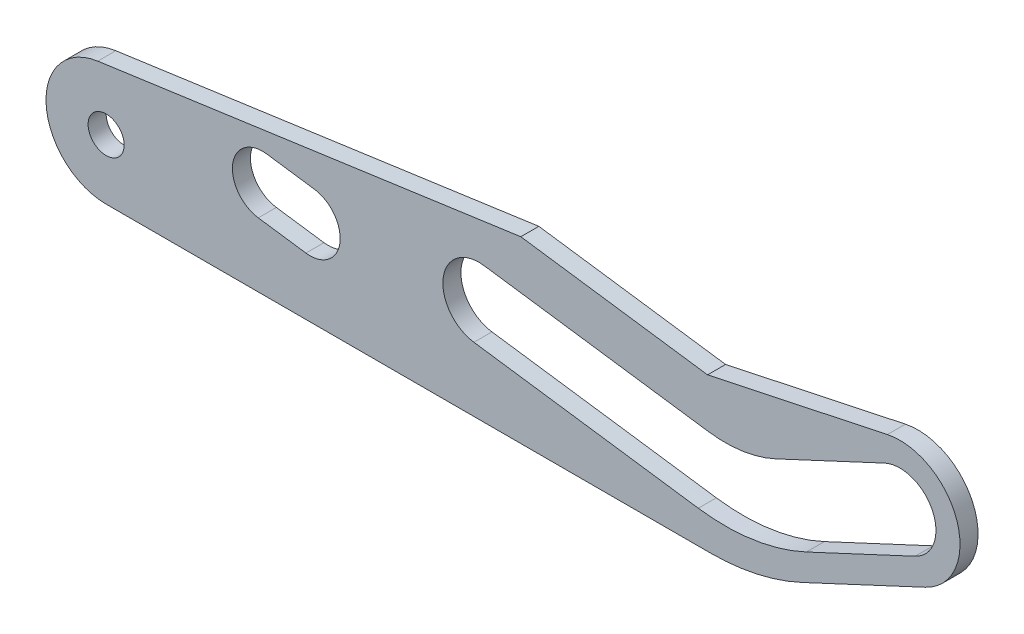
ISO-10303-21;
HEADER;
FILE_DESCRIPTION(('STEP AP214'),'2;1');
FILE_NAME('part.step','',(''),(''),'','','');
FILE_SCHEMA(('AUTOMOTIVE_DESIGN { 1 0 10303 214 1 1 1 1 }'));
ENDSEC;
DATA;
#1=APPLICATION_CONTEXT('core data for automotive mechanical design processes');
#2=APPLICATION_PROTOCOL_DEFINITION('international standard','automotive_design',2000,#1);
#3=PRODUCT_CONTEXT('',#1,'mechanical');
#4=PRODUCT('Part','Part','',(#3));
#5=PRODUCT_RELATED_PRODUCT_CATEGORY('part','',(#4));
#6=PRODUCT_DEFINITION_FORMATION('','',#4);
#7=PRODUCT_DEFINITION_CONTEXT('part definition',#1,'design');
#8=PRODUCT_DEFINITION('design','',#6,#7);
#9=PRODUCT_DEFINITION_SHAPE('','',#8);
#10=(LENGTH_UNIT() NAMED_UNIT(*) SI_UNIT(.MILLI.,.METRE.));
#11=(NAMED_UNIT(*) PLANE_ANGLE_UNIT() SI_UNIT($,.RADIAN.));
#12=(NAMED_UNIT(*) SI_UNIT($,.STERADIAN.) SOLID_ANGLE_UNIT());
#13=UNCERTAINTY_MEASURE_WITH_UNIT(LENGTH_MEASURE(1.E-05),#10,'distance_accuracy_value','');
#14=(GEOMETRIC_REPRESENTATION_CONTEXT(3) GLOBAL_UNCERTAINTY_ASSIGNED_CONTEXT((#13)) GLOBAL_UNIT_ASSIGNED_CONTEXT((#10,
#11,#12)) REPRESENTATION_CONTEXT('',''));
#15=CARTESIAN_POINT('',(0.,0.,0.));
#16=DIRECTION('',(0.,0.,1.));
#17=DIRECTION('',(1.,0.,0.));
#18=AXIS2_PLACEMENT_3D('',#15,#16,#17);
#19=CARTESIAN_POINT('',(0.,0.,0.75));
#20=DIRECTION('',(0.,0.,1.));
#21=DIRECTION('',(1.,0.,0.));
#22=AXIS2_PLACEMENT_3D('',#19,#20,#21);
#23=PLANE('',#22);
#24=CARTESIAN_POINT('',(0.,0.,0.75));
#25=DIRECTION('',(0.,0.,1.));
#26=DIRECTION('',(1.,0.,0.));
#27=AXIS2_PLACEMENT_3D('',#24,#25,#26);
#28=CIRCLE('',#27,1.5);
#29=CARTESIAN_POINT('',(1.5,0.,0.75));
#30=VERTEX_POINT('',#29);
#31=EDGE_CURVE('E180',#30,#30,#28,.T.);
#32=ORIENTED_EDGE('',*,*,#31,.F.);
#33=EDGE_LOOP('',(#32));
#34=FACE_BOUND('',#33,.T.);
#35=CARTESIAN_POINT('',(0.,0.,0.75));
#36=DIRECTION('',(0.,0.,1.));
#37=DIRECTION('',(1.,0.,0.));
#38=AXIS2_PLACEMENT_3D('',#35,#36,#37);
#39=CIRCLE('',#38,5.);
#40=CARTESIAN_POINT('',(-0.695865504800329,4.95134034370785,0.75));
#41=VERTEX_POINT('',#40);
#42=CARTESIAN_POINT('',(0.,-5.,0.75));
#43=VERTEX_POINT('',#42);
#44=EDGE_CURVE('E294',#41,#43,#39,.T.);
#45=ORIENTED_EDGE('',*,*,#44,.T.);
#46=DIRECTION('',(1.,0.,0.));
#47=VECTOR('',#46,1.);
#48=CARTESIAN_POINT('',(0.,-5.,0.75));
#49=LINE('',#48,#47);
#50=CARTESIAN_POINT('',(50.2509278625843,-5.,0.75));
#51=VERTEX_POINT('',#50);
#52=EDGE_CURVE('E297',#43,#51,#49,.T.);
#53=ORIENTED_EDGE('',*,*,#52,.T.);
#54=CARTESIAN_POINT('',(50.2509278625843,13.,0.75));
#55=DIRECTION('',(0.,0.,1.));
#56=DIRECTION('',(1.,0.,0.));
#57=AXIS2_PLACEMENT_3D('',#54,#55,#56);
#58=CIRCLE('',#57,18.);
#59=CARTESIAN_POINT('',(57.8580565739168,-3.31354016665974,0.75));
#60=VERTEX_POINT('',#59);
#61=EDGE_CURVE('E299',#51,#60,#58,.T.);
#62=ORIENTED_EDGE('',*,*,#61,.T.);
#63=DIRECTION('',(0.906307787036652,0.422618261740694,0.));
#64=VECTOR('',#63,1.);
#65=CARTESIAN_POINT('',(68.1130913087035,1.46846106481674,0.75));
#66=LINE('',#65,#64);
#67=CARTESIAN_POINT('',(68.1130913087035,1.46846106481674,0.75));
#68=VERTEX_POINT('',#67);
#69=EDGE_CURVE('E301',#60,#68,#66,.T.);
#70=ORIENTED_EDGE('',*,*,#69,.T.);
#71=CARTESIAN_POINT('',(66.,6.,0.75));
#72=DIRECTION('',(0.,0.,1.));
#73=DIRECTION('',(1.,0.,0.));
#74=AXIS2_PLACEMENT_3D('',#71,#72,#73);
#75=CIRCLE('',#74,5.);
#76=CARTESIAN_POINT('',(64.9604415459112,10.890738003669,0.75));
#77=VERTEX_POINT('',#76);
#78=EDGE_CURVE('E303',#68,#77,#75,.T.);
#79=ORIENTED_EDGE('',*,*,#78,.T.);
#80=DIRECTION('',(-0.978147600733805,-0.207911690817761,0.));
#81=VECTOR('',#80,1.);
#82=CARTESIAN_POINT('',(50.0091398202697,7.71274071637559,0.75));
#83=LINE('',#82,#81);
#84=CARTESIAN_POINT('',(50.0091398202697,7.71274071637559,0.75));
#85=VERTEX_POINT('',#84);
#86=EDGE_CURVE('E305',#77,#85,#83,.T.);
#87=ORIENTED_EDGE('',*,*,#86,.T.);
#88=DIRECTION('',(-0.99026806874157,0.139173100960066,0.));
#89=VECTOR('',#88,1.);
#90=CARTESIAN_POINT('',(34.480829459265,9.89510241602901,0.75));
#91=LINE('',#90,#89);
#92=CARTESIAN_POINT('',(34.480829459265,9.89510241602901,0.75));
#93=VERTEX_POINT('',#92);
#94=EDGE_CURVE('E307',#85,#93,#91,.T.);
#95=ORIENTED_EDGE('',*,*,#94,.T.);
#96=DIRECTION('',(-0.99026806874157,-0.139173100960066,0.));
#97=VECTOR('',#96,1.);
#98=CARTESIAN_POINT('',(-0.695865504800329,4.95134034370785,0.75));
#99=LINE('',#98,#97);
#100=EDGE_CURVE('E309',#93,#41,#99,.T.);
#101=ORIENTED_EDGE('',*,*,#100,.T.);
#102=EDGE_LOOP('',(#45,#53,#62,#70,#79,#87,#95,#101));
#103=FACE_BOUND('',#102,.T.);
#104=DIRECTION('',(0.906307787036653,0.422618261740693,0.));
#105=VECTOR('',#104,1.);
#106=CARTESIAN_POINT('',(67.2678547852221,3.28107663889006,0.75));
#107=LINE('',#106,#105);
#108=CARTESIAN_POINT('',(58.2284860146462,-0.934050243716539,0.75));
#109=VERTEX_POINT('',#108);
#110=CARTESIAN_POINT('',(67.2678547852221,3.28107663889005,0.75));
#111=VERTEX_POINT('',#110);
#112=EDGE_CURVE('E265',#109,#111,#107,.T.);
#113=ORIENTED_EDGE('',*,*,#112,.F.);
#114=CARTESIAN_POINT('',(51.4665938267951,13.5668743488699,0.75));
#115=DIRECTION('',(0.,0.,1.));
#116=DIRECTION('',(1.,0.,0.));
#117=AXIS2_PLACEMENT_3D('',#114,#115,#116);
#118=CIRCLE('',#117,16.);
#119=CARTESIAN_POINT('',(49.239824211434,-2.27741475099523,0.75));
#120=VERTEX_POINT('',#119);
#121=EDGE_CURVE('E263',#120,#109,#118,.T.);
#122=ORIENTED_EDGE('',*,*,#121,.F.);
#123=DIRECTION('',(0.99026806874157,-0.139173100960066,0.));
#124=VECTOR('',#123,1.);
#125=CARTESIAN_POINT('',(30.5824806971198,0.344703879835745,0.75));
#126=LINE('',#125,#124);
#127=CARTESIAN_POINT('',(30.5824806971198,0.344703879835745,0.75));
#128=VERTEX_POINT('',#127);
#129=EDGE_CURVE('E277',#128,#120,#126,.T.);
#130=ORIENTED_EDGE('',*,*,#129,.F.);
#131=CARTESIAN_POINT('',(31.,3.31550808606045,0.75));
#132=DIRECTION('',(0.,0.,1.));
#133=DIRECTION('',(1.,0.,0.));
#134=AXIS2_PLACEMENT_3D('',#131,#132,#133);
#135=CIRCLE('',#134,3.);
#136=CARTESIAN_POINT('',(31.4175193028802,6.28631229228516,0.75));
#137=VERTEX_POINT('',#136);
#138=EDGE_CURVE('E275',#137,#128,#135,.T.);
#139=ORIENTED_EDGE('',*,*,#138,.F.);
#140=DIRECTION('',(-0.99026806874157,0.139173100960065,0.));
#141=VECTOR('',#140,1.);
#142=CARTESIAN_POINT('',(31.4175193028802,6.28631229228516,0.75));
#143=LINE('',#142,#141);
#144=CARTESIAN_POINT('',(50.0748628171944,3.6641936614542,0.75));
#145=VERTEX_POINT('',#144);
#146=EDGE_CURVE('E273',#145,#137,#143,.T.);
#147=ORIENTED_EDGE('',*,*,#146,.F.);
#148=CARTESIAN_POINT('',(51.4665938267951,13.5668743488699,0.75));
#149=DIRECTION('',(0.,0.,-1.));
#150=DIRECTION('',(1.,0.,0.));
#151=AXIS2_PLACEMENT_3D('',#148,#149,#150);
#152=CIRCLE('',#151,9.99999999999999);
#153=CARTESIAN_POINT('',(55.692776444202,4.50379647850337,0.75));
#154=VERTEX_POINT('',#153);
#155=EDGE_CURVE('E271',#154,#145,#152,.T.);
#156=ORIENTED_EDGE('',*,*,#155,.F.);
#157=DIRECTION('',(-0.906307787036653,-0.422618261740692,0.));
#158=VECTOR('',#157,1.);
#159=CARTESIAN_POINT('',(64.7321452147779,8.71892336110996,0.75));
#160=LINE('',#159,#158);
#161=CARTESIAN_POINT('',(64.7321452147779,8.71892336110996,0.75));
#162=VERTEX_POINT('',#161);
#163=EDGE_CURVE('E269',#162,#154,#160,.T.);
#164=ORIENTED_EDGE('',*,*,#163,.F.);
#165=CARTESIAN_POINT('',(66.,6.,0.75));
#166=DIRECTION('',(0.,0.,1.));
#167=DIRECTION('',(1.,0.,0.));
#168=AXIS2_PLACEMENT_3D('',#165,#166,#167);
#169=CIRCLE('',#168,2.99999999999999);
#170=EDGE_CURVE('E267',#111,#162,#169,.T.);
#171=ORIENTED_EDGE('',*,*,#170,.F.);
#172=EDGE_LOOP('',(#113,#122,#130,#139,#147,#156,#164,#171));
#173=FACE_BOUND('',#172,.T.);
#174=DIRECTION('',(-0.99026806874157,0.139173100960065,0.));
#175=VECTOR('',#174,1.);
#176=CARTESIAN_POINT('',(17.3090050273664,4.73473816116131,0.75));
#177=LINE('',#176,#175);
#178=CARTESIAN_POINT('',(17.3090050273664,4.73473816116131,0.75));
#179=VERTEX_POINT('',#178);
#180=CARTESIAN_POINT('',(13.3479327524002,5.29143056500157,0.75));
#181=VERTEX_POINT('',#180);
#182=EDGE_CURVE('E251',#179,#181,#177,.T.);
#183=ORIENTED_EDGE('',*,*,#182,.F.);
#184=CARTESIAN_POINT('',(16.9610722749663,2.25906798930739,0.75));
#185=DIRECTION('',(0.,0.,1.));
#186=DIRECTION('',(1.,0.,0.));
#187=AXIS2_PLACEMENT_3D('',#184,#185,#186);
#188=CIRCLE('',#187,2.5);
#189=CARTESIAN_POINT('',(16.6131395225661,-0.21660218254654,0.75));
#190=VERTEX_POINT('',#189);
#191=EDGE_CURVE('E177',#190,#179,#188,.T.);
#192=ORIENTED_EDGE('',*,*,#191,.F.);
#193=DIRECTION('',(0.99026806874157,-0.139173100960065,0.));
#194=VECTOR('',#193,1.);
#195=CARTESIAN_POINT('',(16.6131395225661,-0.21660218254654,0.75));
#196=LINE('',#195,#194);
#197=CARTESIAN_POINT('',(12.6520672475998,0.340090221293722,0.75));
#198=VERTEX_POINT('',#197);
#199=EDGE_CURVE('E255',#198,#190,#196,.T.);
#200=ORIENTED_EDGE('',*,*,#199,.F.);
#201=CARTESIAN_POINT('',(13.,2.81576039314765,0.75));
#202=DIRECTION('',(0.,0.,1.));
#203=DIRECTION('',(1.,0.,0.));
#204=AXIS2_PLACEMENT_3D('',#201,#202,#203);
#205=CIRCLE('',#204,2.5);
#206=EDGE_CURVE('E253',#181,#198,#205,.T.);
#207=ORIENTED_EDGE('',*,*,#206,.F.);
#208=EDGE_LOOP('',(#183,#192,#200,#207));
#209=FACE_BOUND('',#208,.T.);
#210=ADVANCED_FACE('F33',(#34,#103,#173,#209),#23,.T.);
#211=CARTESIAN_POINT('',(0.,0.,0.75));
#212=DIRECTION('',(0.,0.,-1.));
#213=DIRECTION('',(-1.,0.,0.));
#214=AXIS2_PLACEMENT_3D('',#211,#212,#213);
#215=CYLINDRICAL_SURFACE('',#214,5.);
#216=DIRECTION('',(0.,0.,-1.));
#217=VECTOR('',#216,1.);
#218=CARTESIAN_POINT('',(-0.695865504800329,4.95134034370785,0.75));
#219=LINE('',#218,#217);
#220=CARTESIAN_POINT('',(-0.695865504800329,4.95134034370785,-0.75));
#221=VERTEX_POINT('',#220);
#222=EDGE_CURVE('E311',#41,#221,#219,.T.);
#223=ORIENTED_EDGE('',*,*,#222,.T.);
#224=CARTESIAN_POINT('',(0.,0.,-0.75));
#225=DIRECTION('',(0.,0.,1.));
#226=DIRECTION('',(1.,0.,0.));
#227=AXIS2_PLACEMENT_3D('',#224,#225,#226);
#228=CIRCLE('',#227,5.);
#229=CARTESIAN_POINT('',(0.,-5.,-0.75));
#230=VERTEX_POINT('',#229);
#231=EDGE_CURVE('E226',#221,#230,#228,.T.);
#232=ORIENTED_EDGE('',*,*,#231,.T.);
#233=DIRECTION('',(0.,0.,-1.));
#234=VECTOR('',#233,1.);
#235=CARTESIAN_POINT('',(0.,-5.,0.75));
#236=LINE('',#235,#234);
#237=EDGE_CURVE('E11',#43,#230,#236,.T.);
#238=ORIENTED_EDGE('',*,*,#237,.F.);
#239=ORIENTED_EDGE('',*,*,#44,.F.);
#240=EDGE_LOOP('',(#223,#232,#238,#239));
#241=FACE_BOUND('',#240,.T.);
#242=ADVANCED_FACE('F35',(#241),#215,.T.);
#243=CARTESIAN_POINT('',(0.,-5.,0.75));
#244=DIRECTION('',(0.,1.,0.));
#245=DIRECTION('',(-1.,0.,0.));
#246=AXIS2_PLACEMENT_3D('',#243,#244,#245);
#247=PLANE('',#246);
#248=ORIENTED_EDGE('',*,*,#237,.T.);
#249=DIRECTION('',(1.,0.,0.));
#250=VECTOR('',#249,1.);
#251=CARTESIAN_POINT('',(0.,-5.,-0.75));
#252=LINE('',#251,#250);
#253=CARTESIAN_POINT('',(50.2509278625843,-5.,-0.75));
#254=VERTEX_POINT('',#253);
#255=EDGE_CURVE('E229',#230,#254,#252,.T.);
#256=ORIENTED_EDGE('',*,*,#255,.T.);
#257=DIRECTION('',(0.,0.,-1.));
#258=VECTOR('',#257,1.);
#259=CARTESIAN_POINT('',(50.2509278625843,-5.,0.75));
#260=LINE('',#259,#258);
#261=EDGE_CURVE('E41',#51,#254,#260,.T.);
#262=ORIENTED_EDGE('',*,*,#261,.F.);
#263=ORIENTED_EDGE('',*,*,#52,.F.);
#264=EDGE_LOOP('',(#248,#256,#262,#263));
#265=FACE_BOUND('',#264,.T.);
#266=ADVANCED_FACE('F334',(#265),#247,.F.);
#267=CARTESIAN_POINT('',(50.2509278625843,13.,0.75));
#268=DIRECTION('',(0.,0.,-1.));
#269=DIRECTION('',(-1.,0.,0.));
#270=AXIS2_PLACEMENT_3D('',#267,#268,#269);
#271=CYLINDRICAL_SURFACE('',#270,18.);
#272=ORIENTED_EDGE('',*,*,#261,.T.);
#273=CARTESIAN_POINT('',(50.2509278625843,13.,-0.75));
#274=DIRECTION('',(0.,0.,1.));
#275=DIRECTION('',(1.,0.,0.));
#276=AXIS2_PLACEMENT_3D('',#273,#274,#275);
#277=CIRCLE('',#276,18.);
#278=CARTESIAN_POINT('',(57.8580565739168,-3.31354016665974,-0.75));
#279=VERTEX_POINT('',#278);
#280=EDGE_CURVE('E232',#254,#279,#277,.T.);
#281=ORIENTED_EDGE('',*,*,#280,.T.);
#282=DIRECTION('',(0.,0.,-1.));
#283=VECTOR('',#282,1.);
#284=CARTESIAN_POINT('',(57.8580565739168,-3.31354016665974,0.75));
#285=LINE('',#284,#283);
#286=EDGE_CURVE('E321',#60,#279,#285,.T.);
#287=ORIENTED_EDGE('',*,*,#286,.F.);
#288=ORIENTED_EDGE('',*,*,#61,.F.);
#289=EDGE_LOOP('',(#272,#281,#287,#288));
#290=FACE_BOUND('',#289,.T.);
#291=ADVANCED_FACE('F326',(#290),#271,.T.);
#292=CARTESIAN_POINT('',(68.1130913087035,1.46846106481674,0.75));
#293=DIRECTION('',(-0.422618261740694,0.906307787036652,0.));
#294=DIRECTION('',(-0.906307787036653,-0.422618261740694,0.));
#295=AXIS2_PLACEMENT_3D('',#292,#293,#294);
#296=PLANE('',#295);
#297=ORIENTED_EDGE('',*,*,#286,.T.);
#298=DIRECTION('',(0.906307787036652,0.422618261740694,0.));
#299=VECTOR('',#298,1.);
#300=CARTESIAN_POINT('',(68.1130913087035,1.46846106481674,-0.75));
#301=LINE('',#300,#299);
#302=CARTESIAN_POINT('',(68.1130913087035,1.46846106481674,-0.75));
#303=VERTEX_POINT('',#302);
#304=EDGE_CURVE('E235',#279,#303,#301,.T.);
#305=ORIENTED_EDGE('',*,*,#304,.T.);
#306=DIRECTION('',(0.,0.,-1.));
#307=VECTOR('',#306,1.);
#308=CARTESIAN_POINT('',(68.1130913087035,1.46846106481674,0.75));
#309=LINE('',#308,#307);
#310=EDGE_CURVE('E319',#68,#303,#309,.T.);
#311=ORIENTED_EDGE('',*,*,#310,.F.);
#312=ORIENTED_EDGE('',*,*,#69,.F.);
#313=EDGE_LOOP('',(#297,#305,#311,#312));
#314=FACE_BOUND('',#313,.T.);
#315=ADVANCED_FACE('F359',(#314),#296,.F.);
#316=CARTESIAN_POINT('',(66.,6.,0.75));
#317=DIRECTION('',(0.,0.,-1.));
#318=DIRECTION('',(-1.,0.,0.));
#319=AXIS2_PLACEMENT_3D('',#316,#317,#318);
#320=CYLINDRICAL_SURFACE('',#319,5.);
#321=ORIENTED_EDGE('',*,*,#310,.T.);
#322=CARTESIAN_POINT('',(66.,6.,-0.75));
#323=DIRECTION('',(0.,0.,1.));
#324=DIRECTION('',(1.,0.,0.));
#325=AXIS2_PLACEMENT_3D('',#322,#323,#324);
#326=CIRCLE('',#325,5.);
#327=CARTESIAN_POINT('',(64.9604415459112,10.890738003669,-0.75));
#328=VERTEX_POINT('',#327);
#329=EDGE_CURVE('E238',#303,#328,#326,.T.);
#330=ORIENTED_EDGE('',*,*,#329,.T.);
#331=DIRECTION('',(0.,0.,-1.));
#332=VECTOR('',#331,1.);
#333=CARTESIAN_POINT('',(64.9604415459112,10.890738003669,0.75));
#334=LINE('',#333,#332);
#335=EDGE_CURVE('E317',#77,#328,#334,.T.);
#336=ORIENTED_EDGE('',*,*,#335,.F.);
#337=ORIENTED_EDGE('',*,*,#78,.F.);
#338=EDGE_LOOP('',(#321,#330,#336,#337));
#339=FACE_BOUND('',#338,.T.);
#340=ADVANCED_FACE('F356',(#339),#320,.T.);
#341=CARTESIAN_POINT('',(50.0091398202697,7.71274071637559,0.75));
#342=DIRECTION('',(0.207911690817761,-0.978147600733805,0.));
#343=DIRECTION('',(0.978147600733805,0.207911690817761,0.));
#344=AXIS2_PLACEMENT_3D('',#341,#342,#343);
#345=PLANE('',#344);
#346=ORIENTED_EDGE('',*,*,#335,.T.);
#347=DIRECTION('',(-0.978147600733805,-0.207911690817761,0.));
#348=VECTOR('',#347,1.);
#349=CARTESIAN_POINT('',(50.0091398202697,7.71274071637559,-0.75));
#350=LINE('',#349,#348);
#351=CARTESIAN_POINT('',(50.0091398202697,7.71274071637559,-0.75));
#352=VERTEX_POINT('',#351);
#353=EDGE_CURVE('E241',#328,#352,#350,.T.);
#354=ORIENTED_EDGE('',*,*,#353,.T.);
#355=DIRECTION('',(0.,0.,-1.));
#356=VECTOR('',#355,1.);
#357=CARTESIAN_POINT('',(50.0091398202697,7.71274071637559,0.75));
#358=LINE('',#357,#356);
#359=EDGE_CURVE('E315',#85,#352,#358,.T.);
#360=ORIENTED_EDGE('',*,*,#359,.F.);
#361=ORIENTED_EDGE('',*,*,#86,.F.);
#362=EDGE_LOOP('',(#346,#354,#360,#361));
#363=FACE_BOUND('',#362,.T.);
#364=ADVANCED_FACE('F351',(#363),#345,.F.);
#365=CARTESIAN_POINT('',(34.480829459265,9.89510241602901,0.75));
#366=DIRECTION('',(-0.139173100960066,-0.99026806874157,0.));
#367=DIRECTION('',(0.99026806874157,-0.139173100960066,0.));
#368=AXIS2_PLACEMENT_3D('',#365,#366,#367);
#369=PLANE('',#368);
#370=ORIENTED_EDGE('',*,*,#359,.T.);
#371=DIRECTION('',(-0.99026806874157,0.139173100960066,0.));
#372=VECTOR('',#371,1.);
#373=CARTESIAN_POINT('',(34.480829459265,9.89510241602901,-0.75));
#374=LINE('',#373,#372);
#375=CARTESIAN_POINT('',(34.480829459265,9.89510241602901,-0.75));
#376=VERTEX_POINT('',#375);
#377=EDGE_CURVE('E244',#352,#376,#374,.T.);
#378=ORIENTED_EDGE('',*,*,#377,.T.);
#379=DIRECTION('',(0.,0.,-1.));
#380=VECTOR('',#379,1.);
#381=CARTESIAN_POINT('',(34.480829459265,9.89510241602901,0.75));
#382=LINE('',#381,#380);
#383=EDGE_CURVE('E313',#93,#376,#382,.T.);
#384=ORIENTED_EDGE('',*,*,#383,.F.);
#385=ORIENTED_EDGE('',*,*,#94,.F.);
#386=EDGE_LOOP('',(#370,#378,#384,#385));
#387=FACE_BOUND('',#386,.T.);
#388=ADVANCED_FACE('F347',(#387),#369,.F.);
#389=CARTESIAN_POINT('',(-0.695865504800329,4.95134034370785,0.75));
#390=DIRECTION('',(0.139173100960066,-0.99026806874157,0.));
#391=DIRECTION('',(0.99026806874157,0.139173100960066,0.));
#392=AXIS2_PLACEMENT_3D('',#389,#390,#391);
#393=PLANE('',#392);
#394=ORIENTED_EDGE('',*,*,#383,.T.);
#395=DIRECTION('',(-0.99026806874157,-0.139173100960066,0.));
#396=VECTOR('',#395,1.);
#397=CARTESIAN_POINT('',(-0.695865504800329,4.95134034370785,-0.75));
#398=LINE('',#397,#396);
#399=EDGE_CURVE('E247',#376,#221,#398,.T.);
#400=ORIENTED_EDGE('',*,*,#399,.T.);
#401=ORIENTED_EDGE('',*,*,#222,.F.);
#402=ORIENTED_EDGE('',*,*,#100,.F.);
#403=EDGE_LOOP('',(#394,#400,#401,#402));
#404=FACE_BOUND('',#403,.T.);
#405=ADVANCED_FACE('F342',(#404),#393,.F.);
#406=CARTESIAN_POINT('',(51.4665938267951,13.5668743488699,0.75));
#407=DIRECTION('',(0.,0.,-1.));
#408=DIRECTION('',(-1.,0.,0.));
#409=AXIS2_PLACEMENT_3D('',#406,#407,#408);
#410=CYLINDRICAL_SURFACE('',#409,16.);
#411=DIRECTION('',(0.,0.,-1.));
#412=VECTOR('',#411,1.);
#413=CARTESIAN_POINT('',(58.2284860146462,-0.934050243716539,0.75));
#414=LINE('',#413,#412);
#415=CARTESIAN_POINT('',(58.2284860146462,-0.934050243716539,-0.75));
#416=VERTEX_POINT('',#415);
#417=EDGE_CURVE('E292',#109,#416,#414,.T.);
#418=ORIENTED_EDGE('',*,*,#417,.T.);
#419=CARTESIAN_POINT('',(51.4665938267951,13.5668743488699,-0.75));
#420=DIRECTION('',(0.,0.,1.));
#421=DIRECTION('',(1.,0.,0.));
#422=AXIS2_PLACEMENT_3D('',#419,#420,#421);
#423=CIRCLE('',#422,16.);
#424=CARTESIAN_POINT('',(49.239824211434,-2.27741475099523,-0.75));
#425=VERTEX_POINT('',#424);
#426=EDGE_CURVE('E202',#425,#416,#423,.T.);
#427=ORIENTED_EDGE('',*,*,#426,.F.);
#428=DIRECTION('',(0.,0.,-1.));
#429=VECTOR('',#428,1.);
#430=CARTESIAN_POINT('',(49.239824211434,-2.27741475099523,0.75));
#431=LINE('',#430,#429);
#432=EDGE_CURVE('E279',#120,#425,#431,.T.);
#433=ORIENTED_EDGE('',*,*,#432,.F.);
#434=ORIENTED_EDGE('',*,*,#121,.T.);
#435=EDGE_LOOP('',(#418,#427,#433,#434));
#436=FACE_BOUND('',#435,.T.);
#437=ADVANCED_FACE('F418',(#436),#410,.F.);
#438=CARTESIAN_POINT('',(67.2678547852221,3.28107663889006,0.75));
#439=DIRECTION('',(-0.422618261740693,0.906307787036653,0.));
#440=DIRECTION('',(-0.906307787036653,-0.422618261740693,0.));
#441=AXIS2_PLACEMENT_3D('',#438,#439,#440);
#442=PLANE('',#441);
#443=DIRECTION('',(0.,0.,-1.));
#444=VECTOR('',#443,1.);
#445=CARTESIAN_POINT('',(67.2678547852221,3.28107663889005,0.75));
#446=LINE('',#445,#444);
#447=CARTESIAN_POINT('',(67.2678547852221,3.28107663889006,-0.75));
#448=VERTEX_POINT('',#447);
#449=EDGE_CURVE('E290',#111,#448,#446,.T.);
#450=ORIENTED_EDGE('',*,*,#449,.T.);
#451=DIRECTION('',(0.906307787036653,0.422618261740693,0.));
#452=VECTOR('',#451,1.);
#453=CARTESIAN_POINT('',(67.2678547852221,3.28107663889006,-0.75));
#454=LINE('',#453,#452);
#455=EDGE_CURVE('E205',#416,#448,#454,.T.);
#456=ORIENTED_EDGE('',*,*,#455,.F.);
#457=ORIENTED_EDGE('',*,*,#417,.F.);
#458=ORIENTED_EDGE('',*,*,#112,.T.);
#459=EDGE_LOOP('',(#450,#456,#457,#458));
#460=FACE_BOUND('',#459,.T.);
#461=ADVANCED_FACE('F414',(#460),#442,.T.);
#462=CARTESIAN_POINT('',(66.,6.,0.75));
#463=DIRECTION('',(0.,0.,-1.));
#464=DIRECTION('',(-1.,0.,0.));
#465=AXIS2_PLACEMENT_3D('',#462,#463,#464);
#466=CYLINDRICAL_SURFACE('',#465,2.99999999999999);
#467=DIRECTION('',(0.,0.,-1.));
#468=VECTOR('',#467,1.);
#469=CARTESIAN_POINT('',(64.7321452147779,8.71892336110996,0.75));
#470=LINE('',#469,#468);
#471=CARTESIAN_POINT('',(64.7321452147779,8.71892336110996,-0.75));
#472=VERTEX_POINT('',#471);
#473=EDGE_CURVE('E288',#162,#472,#470,.T.);
#474=ORIENTED_EDGE('',*,*,#473,.T.);
#475=CARTESIAN_POINT('',(66.,6.,-0.75));
#476=DIRECTION('',(0.,0.,1.));
#477=DIRECTION('',(1.,0.,0.));
#478=AXIS2_PLACEMENT_3D('',#475,#476,#477);
#479=CIRCLE('',#478,2.99999999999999);
#480=EDGE_CURVE('E208',#448,#472,#479,.T.);
#481=ORIENTED_EDGE('',*,*,#480,.F.);
#482=ORIENTED_EDGE('',*,*,#449,.F.);
#483=ORIENTED_EDGE('',*,*,#170,.T.);
#484=EDGE_LOOP('',(#474,#481,#482,#483));
#485=FACE_BOUND('',#484,.T.);
#486=ADVANCED_FACE('F410',(#485),#466,.F.);
#487=CARTESIAN_POINT('',(64.7321452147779,8.71892336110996,0.75));
#488=DIRECTION('',(0.422618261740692,-0.906307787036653,0.));
#489=DIRECTION('',(0.906307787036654,0.422618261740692,0.));
#490=AXIS2_PLACEMENT_3D('',#487,#488,#489);
#491=PLANE('',#490);
#492=DIRECTION('',(0.,0.,-1.));
#493=VECTOR('',#492,1.);
#494=CARTESIAN_POINT('',(55.692776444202,4.50379647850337,0.75));
#495=LINE('',#494,#493);
#496=CARTESIAN_POINT('',(55.692776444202,4.50379647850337,-0.75));
#497=VERTEX_POINT('',#496);
#498=EDGE_CURVE('E286',#154,#497,#495,.T.);
#499=ORIENTED_EDGE('',*,*,#498,.T.);
#500=DIRECTION('',(-0.906307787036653,-0.422618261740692,0.));
#501=VECTOR('',#500,1.);
#502=CARTESIAN_POINT('',(64.7321452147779,8.71892336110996,-0.75));
#503=LINE('',#502,#501);
#504=EDGE_CURVE('E211',#472,#497,#503,.T.);
#505=ORIENTED_EDGE('',*,*,#504,.F.);
#506=ORIENTED_EDGE('',*,*,#473,.F.);
#507=ORIENTED_EDGE('',*,*,#163,.T.);
#508=EDGE_LOOP('',(#499,#505,#506,#507));
#509=FACE_BOUND('',#508,.T.);
#510=ADVANCED_FACE('F406',(#509),#491,.T.);
#511=CARTESIAN_POINT('',(51.4665938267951,13.5668743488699,0.75));
#512=DIRECTION('',(0.,0.,-1.));
#513=DIRECTION('',(-1.,0.,0.));
#514=AXIS2_PLACEMENT_3D('',#511,#512,#513);
#515=CYLINDRICAL_SURFACE('',#514,9.99999999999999);
#516=DIRECTION('',(0.,0.,-1.));
#517=VECTOR('',#516,1.);
#518=CARTESIAN_POINT('',(50.0748628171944,3.6641936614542,0.75));
#519=LINE('',#518,#517);
#520=CARTESIAN_POINT('',(50.0748628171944,3.6641936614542,-0.75));
#521=VERTEX_POINT('',#520);
#522=EDGE_CURVE('E284',#145,#521,#519,.T.);
#523=ORIENTED_EDGE('',*,*,#522,.T.);
#524=CARTESIAN_POINT('',(51.4665938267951,13.5668743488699,-0.75));
#525=DIRECTION('',(0.,0.,-1.));
#526=DIRECTION('',(1.,0.,0.));
#527=AXIS2_PLACEMENT_3D('',#524,#525,#526);
#528=CIRCLE('',#527,9.99999999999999);
#529=EDGE_CURVE('E214',#497,#521,#528,.T.);
#530=ORIENTED_EDGE('',*,*,#529,.F.);
#531=ORIENTED_EDGE('',*,*,#498,.F.);
#532=ORIENTED_EDGE('',*,*,#155,.T.);
#533=EDGE_LOOP('',(#523,#530,#531,#532));
#534=FACE_BOUND('',#533,.T.);
#535=ADVANCED_FACE('F402',(#534),#515,.T.);
#536=CARTESIAN_POINT('',(31.4175193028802,6.28631229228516,0.75));
#537=DIRECTION('',(-0.139173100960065,-0.99026806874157,0.));
#538=DIRECTION('',(0.99026806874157,-0.139173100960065,0.));
#539=AXIS2_PLACEMENT_3D('',#536,#537,#538);
#540=PLANE('',#539);
#541=DIRECTION('',(0.,0.,-1.));
#542=VECTOR('',#541,1.);
#543=CARTESIAN_POINT('',(31.4175193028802,6.28631229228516,0.75));
#544=LINE('',#543,#542);
#545=CARTESIAN_POINT('',(31.4175193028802,6.28631229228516,-0.75));
#546=VERTEX_POINT('',#545);
#547=EDGE_CURVE('E282',#137,#546,#544,.T.);
#548=ORIENTED_EDGE('',*,*,#547,.T.);
#549=DIRECTION('',(-0.99026806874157,0.139173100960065,0.));
#550=VECTOR('',#549,1.);
#551=CARTESIAN_POINT('',(31.4175193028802,6.28631229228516,-0.75));
#552=LINE('',#551,#550);
#553=EDGE_CURVE('E217',#521,#546,#552,.T.);
#554=ORIENTED_EDGE('',*,*,#553,.F.);
#555=ORIENTED_EDGE('',*,*,#522,.F.);
#556=ORIENTED_EDGE('',*,*,#146,.T.);
#557=EDGE_LOOP('',(#548,#554,#555,#556));
#558=FACE_BOUND('',#557,.T.);
#559=ADVANCED_FACE('F398',(#558),#540,.T.);
#560=CARTESIAN_POINT('',(31.,3.31550808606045,0.75));
#561=DIRECTION('',(0.,0.,-1.));
#562=DIRECTION('',(-1.,0.,0.));
#563=AXIS2_PLACEMENT_3D('',#560,#561,#562);
#564=CYLINDRICAL_SURFACE('',#563,3.);
#565=DIRECTION('',(0.,0.,-1.));
#566=VECTOR('',#565,1.);
#567=CARTESIAN_POINT('',(30.5824806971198,0.344703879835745,0.75));
#568=LINE('',#567,#566);
#569=CARTESIAN_POINT('',(30.5824806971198,0.344703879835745,-0.75));
#570=VERTEX_POINT('',#569);
#571=EDGE_CURVE('E56',#128,#570,#568,.T.);
#572=ORIENTED_EDGE('',*,*,#571,.T.);
#573=CARTESIAN_POINT('',(31.,3.31550808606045,-0.75));
#574=DIRECTION('',(0.,0.,1.));
#575=DIRECTION('',(1.,0.,0.));
#576=AXIS2_PLACEMENT_3D('',#573,#574,#575);
#577=CIRCLE('',#576,3.);
#578=EDGE_CURVE('E220',#546,#570,#577,.T.);
#579=ORIENTED_EDGE('',*,*,#578,.F.);
#580=ORIENTED_EDGE('',*,*,#547,.F.);
#581=ORIENTED_EDGE('',*,*,#138,.T.);
#582=EDGE_LOOP('',(#572,#579,#580,#581));
#583=FACE_BOUND('',#582,.T.);
#584=ADVANCED_FACE('F395',(#583),#564,.F.);
#585=CARTESIAN_POINT('',(30.5824806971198,0.344703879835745,0.75));
#586=DIRECTION('',(0.139173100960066,0.99026806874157,0.));
#587=DIRECTION('',(-0.99026806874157,0.139173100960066,0.));
#588=AXIS2_PLACEMENT_3D('',#585,#586,#587);
#589=PLANE('',#588);
#590=ORIENTED_EDGE('',*,*,#432,.T.);
#591=DIRECTION('',(0.99026806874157,-0.139173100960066,0.));
#592=VECTOR('',#591,1.);
#593=CARTESIAN_POINT('',(30.5824806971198,0.344703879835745,-0.75));
#594=LINE('',#593,#592);
#595=EDGE_CURVE('E223',#570,#425,#594,.T.);
#596=ORIENTED_EDGE('',*,*,#595,.F.);
#597=ORIENTED_EDGE('',*,*,#571,.F.);
#598=ORIENTED_EDGE('',*,*,#129,.T.);
#599=EDGE_LOOP('',(#590,#596,#597,#598));
#600=FACE_BOUND('',#599,.T.);
#601=ADVANCED_FACE('F391',(#600),#589,.T.);
#602=CARTESIAN_POINT('',(0.,0.,0.75));
#603=DIRECTION('',(0.,0.,-1.));
#604=DIRECTION('',(-1.,0.,0.));
#605=AXIS2_PLACEMENT_3D('',#602,#603,#604);
#606=CYLINDRICAL_SURFACE('',#605,1.5);
#607=ORIENTED_EDGE('',*,*,#31,.T.);
#608=EDGE_LOOP('',(#607));
#609=FACE_BOUND('',#608,.T.);
#610=CARTESIAN_POINT('',(0.,0.,-0.75));
#611=DIRECTION('',(0.,0.,1.));
#612=DIRECTION('',(1.,0.,0.));
#613=AXIS2_PLACEMENT_3D('',#610,#611,#612);
#614=CIRCLE('',#613,1.5);
#615=CARTESIAN_POINT('',(1.5,0.,-0.75));
#616=VERTEX_POINT('',#615);
#617=EDGE_CURVE('E199',#616,#616,#614,.T.);
#618=ORIENTED_EDGE('',*,*,#617,.F.);
#619=EDGE_LOOP('',(#618));
#620=FACE_BOUND('',#619,.T.);
#621=ADVANCED_FACE('F388',(#609,#620),#606,.F.);
#622=CARTESIAN_POINT('',(16.9610722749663,2.25906798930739,0.75));
#623=DIRECTION('',(0.,0.,-1.));
#624=DIRECTION('',(-1.,0.,0.));
#625=AXIS2_PLACEMENT_3D('',#622,#623,#624);
#626=CYLINDRICAL_SURFACE('',#625,2.5);
#627=DIRECTION('',(0.,0.,-1.));
#628=VECTOR('',#627,1.);
#629=CARTESIAN_POINT('',(17.3090050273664,4.73473816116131,0.75));
#630=LINE('',#629,#628);
#631=CARTESIAN_POINT('',(17.3090050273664,4.73473816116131,-0.75));
#632=VERTEX_POINT('',#631);
#633=EDGE_CURVE('E169',#179,#632,#630,.T.);
#634=ORIENTED_EDGE('',*,*,#633,.T.);
#635=CARTESIAN_POINT('',(16.9610722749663,2.25906798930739,-0.75));
#636=DIRECTION('',(0.,0.,1.));
#637=DIRECTION('',(1.,0.,0.));
#638=AXIS2_PLACEMENT_3D('',#635,#636,#637);
#639=CIRCLE('',#638,2.5);
#640=CARTESIAN_POINT('',(16.6131395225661,-0.21660218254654,-0.75));
#641=VERTEX_POINT('',#640);
#642=EDGE_CURVE('E174',#641,#632,#639,.T.);
#643=ORIENTED_EDGE('',*,*,#642,.F.);
#644=DIRECTION('',(0.,0.,-1.));
#645=VECTOR('',#644,1.);
#646=CARTESIAN_POINT('',(16.6131395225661,-0.21660218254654,0.75));
#647=LINE('',#646,#645);
#648=EDGE_CURVE('E257',#190,#641,#647,.T.);
#649=ORIENTED_EDGE('',*,*,#648,.F.);
#650=ORIENTED_EDGE('',*,*,#191,.T.);
#651=EDGE_LOOP('',(#634,#643,#649,#650));
#652=FACE_BOUND('',#651,.T.);
#653=ADVANCED_FACE('F171',(#652),#626,.F.);
#654=CARTESIAN_POINT('',(17.3090050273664,4.73473816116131,0.75));
#655=DIRECTION('',(-0.139173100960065,-0.99026806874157,0.));
#656=DIRECTION('',(0.99026806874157,-0.139173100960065,0.));
#657=AXIS2_PLACEMENT_3D('',#654,#655,#656);
#658=PLANE('',#657);
#659=DIRECTION('',(0.,0.,-1.));
#660=VECTOR('',#659,1.);
#661=CARTESIAN_POINT('',(13.3479327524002,5.29143056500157,0.75));
#662=LINE('',#661,#660);
#663=CARTESIAN_POINT('',(13.3479327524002,5.29143056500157,-0.75));
#664=VERTEX_POINT('',#663);
#665=EDGE_CURVE('E181',#181,#664,#662,.T.);
#666=ORIENTED_EDGE('',*,*,#665,.T.);
#667=DIRECTION('',(-0.99026806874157,0.139173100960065,0.));
#668=VECTOR('',#667,1.);
#669=CARTESIAN_POINT('',(17.3090050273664,4.73473816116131,-0.75));
#670=LINE('',#669,#668);
#671=EDGE_CURVE('E184',#632,#664,#670,.T.);
#672=ORIENTED_EDGE('',*,*,#671,.F.);
#673=ORIENTED_EDGE('',*,*,#633,.F.);
#674=ORIENTED_EDGE('',*,*,#182,.T.);
#675=EDGE_LOOP('',(#666,#672,#673,#674));
#676=FACE_BOUND('',#675,.T.);
#677=ADVANCED_FACE('F185',(#676),#658,.T.);
#678=CARTESIAN_POINT('',(13.,2.81576039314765,0.75));
#679=DIRECTION('',(0.,0.,-1.));
#680=DIRECTION('',(-1.,0.,0.));
#681=AXIS2_PLACEMENT_3D('',#678,#679,#680);
#682=CYLINDRICAL_SURFACE('',#681,2.5);
#683=DIRECTION('',(0.,0.,-1.));
#684=VECTOR('',#683,1.);
#685=CARTESIAN_POINT('',(12.6520672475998,0.340090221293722,0.75));
#686=LINE('',#685,#684);
#687=CARTESIAN_POINT('',(12.6520672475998,0.340090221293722,-0.75));
#688=VERTEX_POINT('',#687);
#689=EDGE_CURVE('E48',#198,#688,#686,.T.);
#690=ORIENTED_EDGE('',*,*,#689,.T.);
#691=CARTESIAN_POINT('',(13.,2.81576039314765,-0.75));
#692=DIRECTION('',(0.,0.,1.));
#693=DIRECTION('',(1.,0.,0.));
#694=AXIS2_PLACEMENT_3D('',#691,#692,#693);
#695=CIRCLE('',#694,2.5);
#696=EDGE_CURVE('E190',#664,#688,#695,.T.);
#697=ORIENTED_EDGE('',*,*,#696,.F.);
#698=ORIENTED_EDGE('',*,*,#665,.F.);
#699=ORIENTED_EDGE('',*,*,#206,.T.);
#700=EDGE_LOOP('',(#690,#697,#698,#699));
#701=FACE_BOUND('',#700,.T.);
#702=ADVANCED_FACE('F373',(#701),#682,.F.);
#703=CARTESIAN_POINT('',(16.6131395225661,-0.21660218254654,0.75));
#704=DIRECTION('',(0.139173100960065,0.99026806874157,0.));
#705=DIRECTION('',(-0.99026806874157,0.139173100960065,0.));
#706=AXIS2_PLACEMENT_3D('',#703,#704,#705);
#707=PLANE('',#706);
#708=ORIENTED_EDGE('',*,*,#648,.T.);
#709=DIRECTION('',(0.99026806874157,-0.139173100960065,0.));
#710=VECTOR('',#709,1.);
#711=CARTESIAN_POINT('',(16.6131395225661,-0.21660218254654,-0.75));
#712=LINE('',#711,#710);
#713=EDGE_CURVE('E194',#688,#641,#712,.T.);
#714=ORIENTED_EDGE('',*,*,#713,.F.);
#715=ORIENTED_EDGE('',*,*,#689,.F.);
#716=ORIENTED_EDGE('',*,*,#199,.T.);
#717=EDGE_LOOP('',(#708,#714,#715,#716));
#718=FACE_BOUND('',#717,.T.);
#719=ADVANCED_FACE('F374',(#718),#707,.T.);
#720=CARTESIAN_POINT('',(0.,0.,-0.75));
#721=DIRECTION('',(0.,0.,1.));
#722=DIRECTION('',(1.,0.,0.));
#723=AXIS2_PLACEMENT_3D('',#720,#721,#722);
#724=PLANE('',#723);
#725=ORIENTED_EDGE('',*,*,#713,.T.);
#726=ORIENTED_EDGE('',*,*,#642,.T.);
#727=ORIENTED_EDGE('',*,*,#671,.T.);
#728=ORIENTED_EDGE('',*,*,#696,.T.);
#729=EDGE_LOOP('',(#725,#726,#727,#728));
#730=FACE_BOUND('',#729,.T.);
#731=ORIENTED_EDGE('',*,*,#617,.T.);
#732=EDGE_LOOP('',(#731));
#733=FACE_BOUND('',#732,.T.);
#734=ORIENTED_EDGE('',*,*,#595,.T.);
#735=ORIENTED_EDGE('',*,*,#426,.T.);
#736=ORIENTED_EDGE('',*,*,#455,.T.);
#737=ORIENTED_EDGE('',*,*,#480,.T.);
#738=ORIENTED_EDGE('',*,*,#504,.T.);
#739=ORIENTED_EDGE('',*,*,#529,.T.);
#740=ORIENTED_EDGE('',*,*,#553,.T.);
#741=ORIENTED_EDGE('',*,*,#578,.T.);
#742=EDGE_LOOP('',(#734,#735,#736,#737,#738,#739,#740,#741));
#743=FACE_BOUND('',#742,.T.);
#744=ORIENTED_EDGE('',*,*,#231,.F.);
#745=ORIENTED_EDGE('',*,*,#399,.F.);
#746=ORIENTED_EDGE('',*,*,#377,.F.);
#747=ORIENTED_EDGE('',*,*,#353,.F.);
#748=ORIENTED_EDGE('',*,*,#329,.F.);
#749=ORIENTED_EDGE('',*,*,#304,.F.);
#750=ORIENTED_EDGE('',*,*,#280,.F.);
#751=ORIENTED_EDGE('',*,*,#255,.F.);
#752=EDGE_LOOP('',(#744,#745,#746,#747,#748,#749,#750,#751));
#753=FACE_BOUND('',#752,.T.);
#754=ADVANCED_FACE('F192',(#730,#733,#743,#753),#724,.F.);
#755=CLOSED_SHELL('',(#210,#242,#266,#291,#315,#340,#364,#388,#405,#437,#461,#486,#510,#535,
#559,#584,#601,#621,#653,#677,#702,#719,#754));
#756=MANIFOLD_SOLID_BREP('B2',#755);
#757=ADVANCED_BREP_SHAPE_REPRESENTATION('',(#18,#756),#14);
#758=SHAPE_DEFINITION_REPRESENTATION(#9,#757);
ENDSEC;
END-ISO-10303-21;
